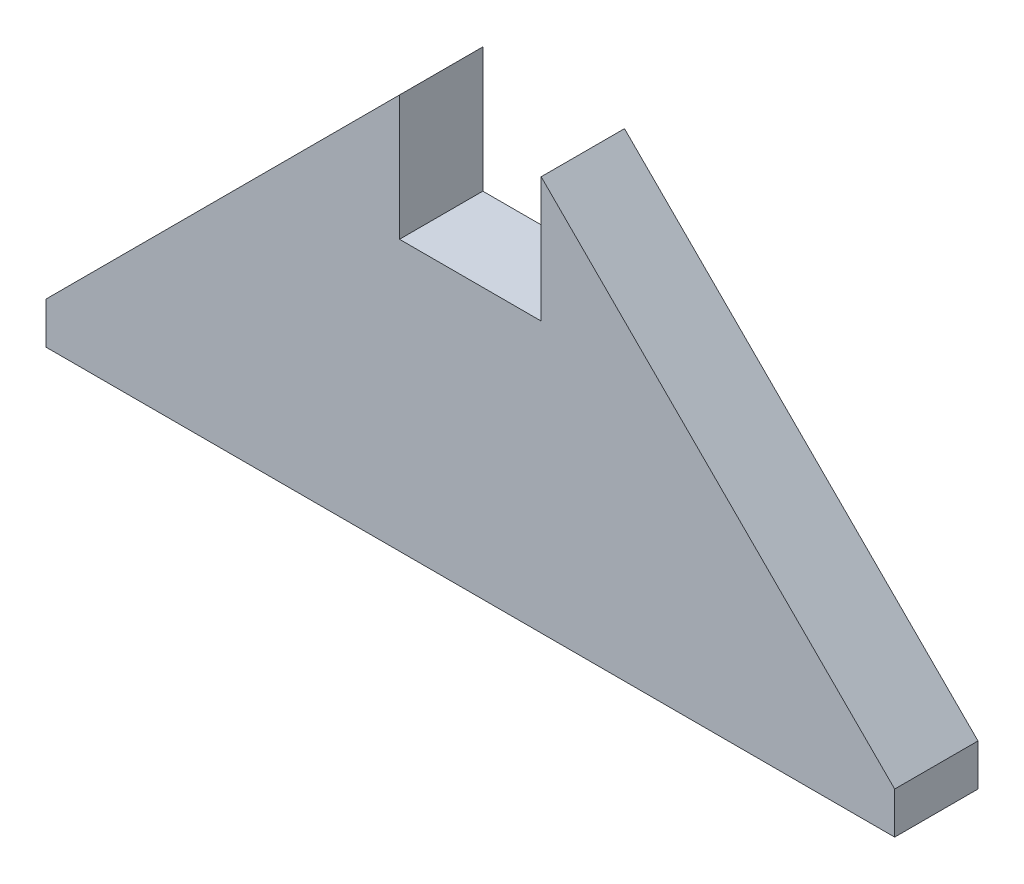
from build123d import *

# Parameters (mm, degrees)
AUFSATZ_LINEAR_AUSTRAGEN1_DEPTH = 10


with BuildPart() as part:
    # Skizze1 → Aufsatz-Linear austragen1 (new body)
    with BuildSketch(Plane.XY):
        Polygon((0, 0), (0, -5), (101.852813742, -5), (101.852813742, 0), (59.426406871, 42.426406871), (59.426406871, 27.426406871), (42.426406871, 27.426406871), (42.426406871, 42.426406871), align=None)
    extrude(amount=AUFSATZ_LINEAR_AUSTRAGEN1_DEPTH)


solid = part.part
